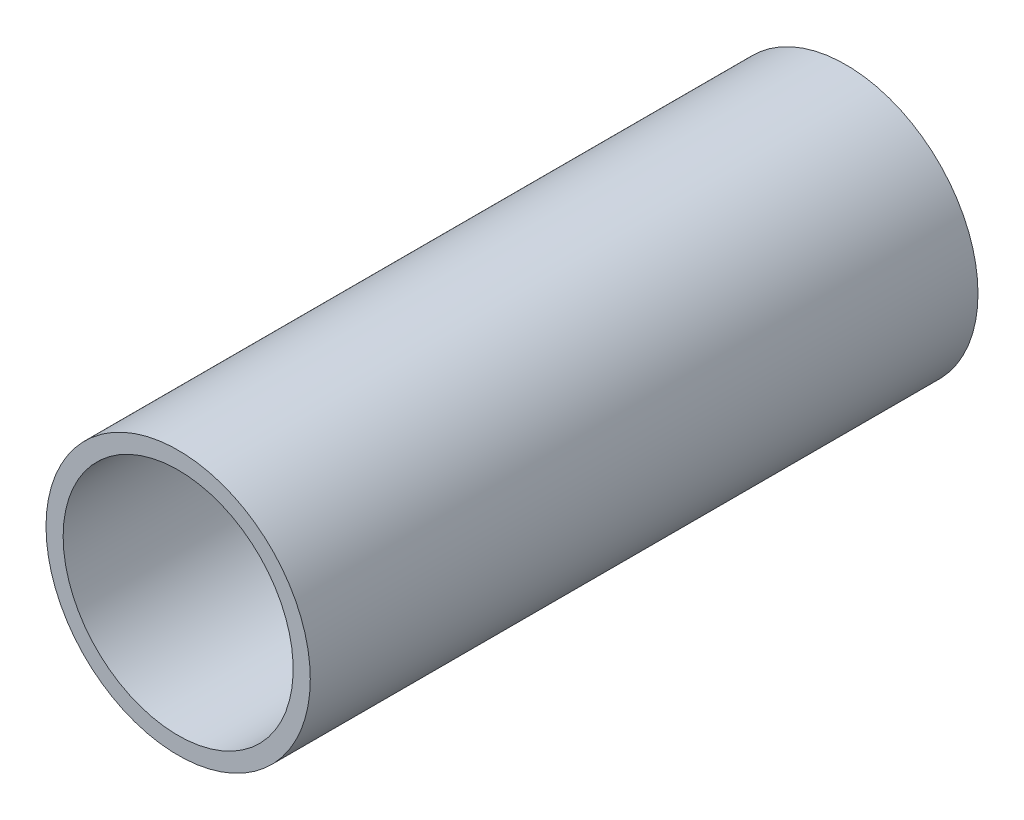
ISO-10303-21;
HEADER;
FILE_DESCRIPTION(('STEP AP214'),'2;1');
FILE_NAME('part.step','',(''),(''),'','','');
FILE_SCHEMA(('AUTOMOTIVE_DESIGN { 1 0 10303 214 1 1 1 1 }'));
ENDSEC;
DATA;
#1=APPLICATION_CONTEXT('core data for automotive mechanical design processes');
#2=APPLICATION_PROTOCOL_DEFINITION('international standard','automotive_design',2000,#1);
#3=PRODUCT_CONTEXT('',#1,'mechanical');
#4=PRODUCT('Part','Part','',(#3));
#5=PRODUCT_RELATED_PRODUCT_CATEGORY('part','',(#4));
#6=PRODUCT_DEFINITION_FORMATION('','',#4);
#7=PRODUCT_DEFINITION_CONTEXT('part definition',#1,'design');
#8=PRODUCT_DEFINITION('design','',#6,#7);
#9=PRODUCT_DEFINITION_SHAPE('','',#8);
#10=(LENGTH_UNIT() NAMED_UNIT(*) SI_UNIT(.MILLI.,.METRE.));
#11=(NAMED_UNIT(*) PLANE_ANGLE_UNIT() SI_UNIT($,.RADIAN.));
#12=(NAMED_UNIT(*) SI_UNIT($,.STERADIAN.) SOLID_ANGLE_UNIT());
#13=UNCERTAINTY_MEASURE_WITH_UNIT(LENGTH_MEASURE(1.E-05),#10,'distance_accuracy_value','');
#14=(GEOMETRIC_REPRESENTATION_CONTEXT(3) GLOBAL_UNCERTAINTY_ASSIGNED_CONTEXT((#13)) GLOBAL_UNIT_ASSIGNED_CONTEXT((#10,
#11,#12)) REPRESENTATION_CONTEXT('',''));
#15=CARTESIAN_POINT('',(0.,0.,0.));
#16=DIRECTION('',(0.,0.,1.));
#17=DIRECTION('',(1.,0.,0.));
#18=AXIS2_PLACEMENT_3D('',#15,#16,#17);
#19=CARTESIAN_POINT('',(0.,0.,76.2));
#20=DIRECTION('',(0.,0.,1.));
#21=DIRECTION('',(1.,0.,0.));
#22=AXIS2_PLACEMENT_3D('',#19,#20,#21);
#23=PLANE('',#22);
#24=CARTESIAN_POINT('',(0.,0.,76.2));
#25=DIRECTION('',(0.,0.,1.));
#26=DIRECTION('',(1.,0.,0.));
#27=AXIS2_PLACEMENT_3D('',#24,#25,#26);
#28=CIRCLE('',#27,30.1625);
#29=CARTESIAN_POINT('',(-30.1625,0.,76.2));
#30=VERTEX_POINT('',#29);
#31=EDGE_CURVE('E11',#30,#30,#28,.T.);
#32=ORIENTED_EDGE('',*,*,#31,.T.);
#33=EDGE_LOOP('',(#32));
#34=FACE_BOUND('',#33,.T.);
#35=CARTESIAN_POINT('',(0.,0.,76.2));
#36=DIRECTION('',(0.,0.,1.));
#37=DIRECTION('',(1.,0.,0.));
#38=AXIS2_PLACEMENT_3D('',#35,#36,#37);
#39=CIRCLE('',#38,26.2509);
#40=CARTESIAN_POINT('',(-26.2509,0.,76.2));
#41=VERTEX_POINT('',#40);
#42=EDGE_CURVE('E50',#41,#41,#39,.T.);
#43=ORIENTED_EDGE('',*,*,#42,.F.);
#44=EDGE_LOOP('',(#43));
#45=FACE_BOUND('',#44,.T.);
#46=ADVANCED_FACE('F38',(#34,#45),#23,.T.);
#47=CARTESIAN_POINT('',(0.,0.,-76.2));
#48=DIRECTION('',(0.,0.,1.));
#49=DIRECTION('',(1.,0.,0.));
#50=AXIS2_PLACEMENT_3D('',#47,#48,#49);
#51=PLANE('',#50);
#52=CARTESIAN_POINT('',(0.,0.,-76.2));
#53=DIRECTION('',(0.,0.,1.));
#54=DIRECTION('',(1.,0.,0.));
#55=AXIS2_PLACEMENT_3D('',#52,#53,#54);
#56=CIRCLE('',#55,30.1625);
#57=CARTESIAN_POINT('',(-30.1625,0.,-76.2));
#58=VERTEX_POINT('',#57);
#59=EDGE_CURVE('E42',#58,#58,#56,.T.);
#60=ORIENTED_EDGE('',*,*,#59,.F.);
#61=EDGE_LOOP('',(#60));
#62=FACE_BOUND('',#61,.T.);
#63=CARTESIAN_POINT('',(0.,0.,-76.2));
#64=DIRECTION('',(0.,0.,1.));
#65=DIRECTION('',(1.,0.,0.));
#66=AXIS2_PLACEMENT_3D('',#63,#64,#65);
#67=CIRCLE('',#66,26.2509);
#68=CARTESIAN_POINT('',(-26.2509,0.,-76.2));
#69=VERTEX_POINT('',#68);
#70=EDGE_CURVE('E52',#69,#69,#67,.T.);
#71=ORIENTED_EDGE('',*,*,#70,.T.);
#72=EDGE_LOOP('',(#71));
#73=FACE_BOUND('',#72,.T.);
#74=ADVANCED_FACE('F63',(#62,#73),#51,.F.);
#75=CARTESIAN_POINT('',(0.,0.,76.2));
#76=DIRECTION('',(0.,0.,-1.));
#77=DIRECTION('',(-1.,0.,0.));
#78=AXIS2_PLACEMENT_3D('',#75,#76,#77);
#79=CYLINDRICAL_SURFACE('',#78,30.1625);
#80=CARTESIAN_POINT('',(-30.1625,0.,76.2));
#81=CARTESIAN_POINT('',(-30.1625,0.,74.6125));
#82=CARTESIAN_POINT('',(-30.1625,0.,73.025));
#83=CARTESIAN_POINT('',(-30.1625,0.,69.85));
#84=CARTESIAN_POINT('',(-30.1625,0.,68.2625));
#85=CARTESIAN_POINT('',(-30.1625,0.,65.0875));
#86=CARTESIAN_POINT('',(-30.1625,0.,63.5));
#87=CARTESIAN_POINT('',(-30.1625,0.,60.325));
#88=CARTESIAN_POINT('',(-30.1625,0.,58.7375));
#89=CARTESIAN_POINT('',(-30.1625,0.,55.5625));
#90=CARTESIAN_POINT('',(-30.1625,0.,53.975));
#91=CARTESIAN_POINT('',(-30.1625,0.,50.8));
#92=CARTESIAN_POINT('',(-30.1625,0.,49.2125));
#93=CARTESIAN_POINT('',(-30.1625,0.,46.0375));
#94=CARTESIAN_POINT('',(-30.1625,0.,44.45));
#95=CARTESIAN_POINT('',(-30.1625,0.,41.275));
#96=CARTESIAN_POINT('',(-30.1625,0.,39.6875));
#97=CARTESIAN_POINT('',(-30.1625,0.,36.5125));
#98=CARTESIAN_POINT('',(-30.1625,0.,34.925));
#99=CARTESIAN_POINT('',(-30.1625,0.,31.75));
#100=CARTESIAN_POINT('',(-30.1625,0.,30.1625));
#101=CARTESIAN_POINT('',(-30.1625,0.,26.9875));
#102=CARTESIAN_POINT('',(-30.1625,0.,25.4));
#103=CARTESIAN_POINT('',(-30.1625,0.,22.225));
#104=CARTESIAN_POINT('',(-30.1625,0.,20.6375));
#105=CARTESIAN_POINT('',(-30.1625,0.,17.4625));
#106=CARTESIAN_POINT('',(-30.1625,0.,15.875));
#107=CARTESIAN_POINT('',(-30.1625,0.,12.7));
#108=CARTESIAN_POINT('',(-30.1625,0.,11.1125));
#109=CARTESIAN_POINT('',(-30.1625,0.,7.93749999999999));
#110=CARTESIAN_POINT('',(-30.1625,0.,6.34999999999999));
#111=CARTESIAN_POINT('',(-30.1625,0.,3.17499999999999));
#112=CARTESIAN_POINT('',(-30.1625,0.,1.58749999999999));
#113=CARTESIAN_POINT('',(-30.1625,0.,-1.58750000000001));
#114=CARTESIAN_POINT('',(-30.1625,0.,-3.17500000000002));
#115=CARTESIAN_POINT('',(-30.1625,0.,-6.35000000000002));
#116=CARTESIAN_POINT('',(-30.1625,0.,-7.93750000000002));
#117=CARTESIAN_POINT('',(-30.1625,0.,-11.1125));
#118=CARTESIAN_POINT('',(-30.1625,0.,-12.7));
#119=CARTESIAN_POINT('',(-30.1625,0.,-15.875));
#120=CARTESIAN_POINT('',(-30.1625,0.,-17.4625));
#121=CARTESIAN_POINT('',(-30.1625,0.,-20.6375));
#122=CARTESIAN_POINT('',(-30.1625,0.,-22.225));
#123=CARTESIAN_POINT('',(-30.1625,0.,-25.4));
#124=CARTESIAN_POINT('',(-30.1625,0.,-26.9875));
#125=CARTESIAN_POINT('',(-30.1625,0.,-30.1625));
#126=CARTESIAN_POINT('',(-30.1625,0.,-31.75));
#127=CARTESIAN_POINT('',(-30.1625,0.,-34.925));
#128=CARTESIAN_POINT('',(-30.1625,0.,-36.5125));
#129=CARTESIAN_POINT('',(-30.1625,0.,-39.6875));
#130=CARTESIAN_POINT('',(-30.1625,0.,-41.275));
#131=CARTESIAN_POINT('',(-30.1625,0.,-44.45));
#132=CARTESIAN_POINT('',(-30.1625,0.,-46.0375));
#133=CARTESIAN_POINT('',(-30.1625,0.,-49.2125));
#134=CARTESIAN_POINT('',(-30.1625,0.,-50.8));
#135=CARTESIAN_POINT('',(-30.1625,0.,-53.975));
#136=CARTESIAN_POINT('',(-30.1625,0.,-55.5625));
#137=CARTESIAN_POINT('',(-30.1625,0.,-58.7375));
#138=CARTESIAN_POINT('',(-30.1625,0.,-60.325));
#139=CARTESIAN_POINT('',(-30.1625,0.,-63.5));
#140=CARTESIAN_POINT('',(-30.1625,0.,-65.0875));
#141=CARTESIAN_POINT('',(-30.1625,0.,-68.2625));
#142=CARTESIAN_POINT('',(-30.1625,0.,-69.85));
#143=CARTESIAN_POINT('',(-30.1625,0.,-73.025));
#144=CARTESIAN_POINT('',(-30.1625,0.,-74.6125));
#145=CARTESIAN_POINT('',(-30.1625,0.,-76.2));
#146=B_SPLINE_CURVE_WITH_KNOTS('',3,(#80,#81,#82,#83,#84,#85,#86,#87,#88,#89,#90,#91,#92,#93,
#94,#95,#96,#97,#98,#99,#100,#101,#102,#103,#104,#105,#106,#107,#108,#109,#110,#111,#112,#113,
#114,#115,#116,#117,#118,#119,#120,#121,#122,#123,#124,#125,#126,#127,#128,#129,#130,#131,#132,
#133,#134,#135,#136,#137,#138,#139,#140,#141,#142,#143,#144,#145),.UNSPECIFIED.,.F.,.F.,(4,2,2,
2,2,2,2,2,2,2,2,2,2,2,2,2,2,2,2,2,2,2,2,2,2,2,2,2,2,2,2,2,4),(0.,4.76249999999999,
9.52499999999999,14.2875,19.05,23.8125,28.575,33.3375,38.1,42.8625,47.625,52.3875,57.15,61.9125,
66.675,71.4375,76.2,80.9625,85.725,90.4875,95.25,100.0125,104.775,109.5375,114.3,119.0625,
123.825,128.5875,133.35,138.1125,142.875,147.6375,152.4),.UNSPECIFIED.);
#147=EDGE_CURVE('BSEAM40',#30,#58,#146,.T.);
#148=ORIENTED_EDGE('',*,*,#31,.F.);
#149=ORIENTED_EDGE('',*,*,#59,.T.);
#150=ORIENTED_EDGE('',*,*,#147,.T.);
#151=ORIENTED_EDGE('',*,*,#147,.F.);
#152=EDGE_LOOP('',(#148,#150,#149,#151));
#153=FACE_BOUND('',#152,.T.);
#154=ADVANCED_FACE('F40',(#153),#79,.T.);
#155=CARTESIAN_POINT('',(0.,0.,76.2));
#156=DIRECTION('',(0.,0.,-1.));
#157=DIRECTION('',(-1.,0.,0.));
#158=AXIS2_PLACEMENT_3D('',#155,#156,#157);
#159=CYLINDRICAL_SURFACE('',#158,26.2509);
#160=CARTESIAN_POINT('',(-26.2509,0.,76.2));
#161=CARTESIAN_POINT('',(-26.2509,0.,74.6125));
#162=CARTESIAN_POINT('',(-26.2509,0.,73.025));
#163=CARTESIAN_POINT('',(-26.2509,0.,69.85));
#164=CARTESIAN_POINT('',(-26.2509,0.,68.2625));
#165=CARTESIAN_POINT('',(-26.2509,0.,65.0875));
#166=CARTESIAN_POINT('',(-26.2509,0.,63.5));
#167=CARTESIAN_POINT('',(-26.2509,0.,60.325));
#168=CARTESIAN_POINT('',(-26.2509,0.,58.7375));
#169=CARTESIAN_POINT('',(-26.2509,0.,55.5625));
#170=CARTESIAN_POINT('',(-26.2509,0.,53.975));
#171=CARTESIAN_POINT('',(-26.2509,0.,50.8));
#172=CARTESIAN_POINT('',(-26.2509,0.,49.2125));
#173=CARTESIAN_POINT('',(-26.2509,0.,46.0375));
#174=CARTESIAN_POINT('',(-26.2509,0.,44.45));
#175=CARTESIAN_POINT('',(-26.2509,0.,41.275));
#176=CARTESIAN_POINT('',(-26.2509,0.,39.6875));
#177=CARTESIAN_POINT('',(-26.2509,0.,36.5125));
#178=CARTESIAN_POINT('',(-26.2509,0.,34.925));
#179=CARTESIAN_POINT('',(-26.2509,0.,31.75));
#180=CARTESIAN_POINT('',(-26.2509,0.,30.1625));
#181=CARTESIAN_POINT('',(-26.2509,0.,26.9875));
#182=CARTESIAN_POINT('',(-26.2509,0.,25.4));
#183=CARTESIAN_POINT('',(-26.2509,0.,22.225));
#184=CARTESIAN_POINT('',(-26.2509,0.,20.6375));
#185=CARTESIAN_POINT('',(-26.2509,0.,17.4625));
#186=CARTESIAN_POINT('',(-26.2509,0.,15.875));
#187=CARTESIAN_POINT('',(-26.2509,0.,12.7));
#188=CARTESIAN_POINT('',(-26.2509,0.,11.1125));
#189=CARTESIAN_POINT('',(-26.2509,0.,7.93749999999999));
#190=CARTESIAN_POINT('',(-26.2509,0.,6.34999999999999));
#191=CARTESIAN_POINT('',(-26.2509,0.,3.17499999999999));
#192=CARTESIAN_POINT('',(-26.2509,0.,1.58749999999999));
#193=CARTESIAN_POINT('',(-26.2509,0.,-1.58750000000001));
#194=CARTESIAN_POINT('',(-26.2509,0.,-3.17500000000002));
#195=CARTESIAN_POINT('',(-26.2509,0.,-6.35000000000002));
#196=CARTESIAN_POINT('',(-26.2509,0.,-7.93750000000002));
#197=CARTESIAN_POINT('',(-26.2509,0.,-11.1125));
#198=CARTESIAN_POINT('',(-26.2509,0.,-12.7));
#199=CARTESIAN_POINT('',(-26.2509,0.,-15.875));
#200=CARTESIAN_POINT('',(-26.2509,0.,-17.4625));
#201=CARTESIAN_POINT('',(-26.2509,0.,-20.6375));
#202=CARTESIAN_POINT('',(-26.2509,0.,-22.225));
#203=CARTESIAN_POINT('',(-26.2509,0.,-25.4));
#204=CARTESIAN_POINT('',(-26.2509,0.,-26.9875));
#205=CARTESIAN_POINT('',(-26.2509,0.,-30.1625));
#206=CARTESIAN_POINT('',(-26.2509,0.,-31.75));
#207=CARTESIAN_POINT('',(-26.2509,0.,-34.925));
#208=CARTESIAN_POINT('',(-26.2509,0.,-36.5125));
#209=CARTESIAN_POINT('',(-26.2509,0.,-39.6875));
#210=CARTESIAN_POINT('',(-26.2509,0.,-41.275));
#211=CARTESIAN_POINT('',(-26.2509,0.,-44.45));
#212=CARTESIAN_POINT('',(-26.2509,0.,-46.0375));
#213=CARTESIAN_POINT('',(-26.2509,0.,-49.2125));
#214=CARTESIAN_POINT('',(-26.2509,0.,-50.8));
#215=CARTESIAN_POINT('',(-26.2509,0.,-53.975));
#216=CARTESIAN_POINT('',(-26.2509,0.,-55.5625));
#217=CARTESIAN_POINT('',(-26.2509,0.,-58.7375));
#218=CARTESIAN_POINT('',(-26.2509,0.,-60.325));
#219=CARTESIAN_POINT('',(-26.2509,0.,-63.5));
#220=CARTESIAN_POINT('',(-26.2509,0.,-65.0875));
#221=CARTESIAN_POINT('',(-26.2509,0.,-68.2625));
#222=CARTESIAN_POINT('',(-26.2509,0.,-69.85));
#223=CARTESIAN_POINT('',(-26.2509,0.,-73.025));
#224=CARTESIAN_POINT('',(-26.2509,0.,-74.6125));
#225=CARTESIAN_POINT('',(-26.2509,0.,-76.2));
#226=B_SPLINE_CURVE_WITH_KNOTS('',3,(#160,#161,#162,#163,#164,#165,#166,#167,#168,#169,#170,
#171,#172,#173,#174,#175,#176,#177,#178,#179,#180,#181,#182,#183,#184,#185,#186,#187,#188,#189,
#190,#191,#192,#193,#194,#195,#196,#197,#198,#199,#200,#201,#202,#203,#204,#205,#206,#207,#208,
#209,#210,#211,#212,#213,#214,#215,#216,#217,#218,#219,#220,#221,#222,#223,#224,#225),
.UNSPECIFIED.,.F.,.F.,(4,2,2,2,2,2,2,2,2,2,2,2,2,2,2,2,2,2,2,2,2,2,2,2,2,2,2,2,2,2,2,2,4),(0.,
4.76249999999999,9.52499999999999,14.2875,19.05,23.8125,28.575,33.3375,38.1,42.8625,47.625,
52.3875,57.15,61.9125,66.675,71.4375,76.2,80.9625,85.725,90.4875,95.25,100.0125,104.775,
109.5375,114.3,119.0625,123.825,128.5875,133.35,138.1125,142.875,147.6375,152.4),.UNSPECIFIED.);
#227=EDGE_CURVE('BSEAM59',#41,#69,#226,.T.);
#228=ORIENTED_EDGE('',*,*,#42,.T.);
#229=ORIENTED_EDGE('',*,*,#70,.F.);
#230=ORIENTED_EDGE('',*,*,#227,.T.);
#231=ORIENTED_EDGE('',*,*,#227,.F.);
#232=EDGE_LOOP('',(#228,#230,#229,#231));
#233=FACE_BOUND('',#232,.T.);
#234=ADVANCED_FACE('F59',(#233),#159,.F.);
#235=CLOSED_SHELL('',(#46,#74,#154,#234));
#236=MANIFOLD_SOLID_BREP('B2',#235);
#237=ADVANCED_BREP_SHAPE_REPRESENTATION('',(#18,#236),#14);
#238=SHAPE_DEFINITION_REPRESENTATION(#9,#237);
ENDSEC;
END-ISO-10303-21;
